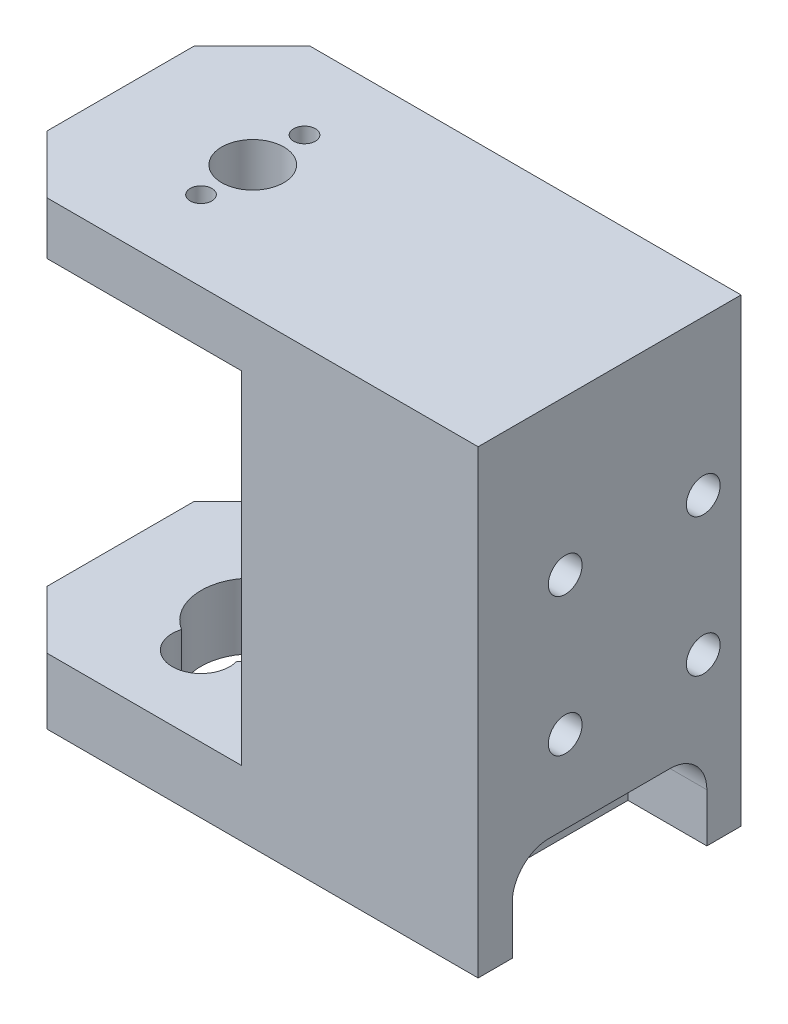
from build123d import *

# Parameters (mm, degrees)
EXTRUDE1_DEPTH                 = 12.7
SKETCH3_W                      = 3.7084
SKETCH3_H                      = 38.1
CUT_EXTRUDE1_DEPTH             = 1.27
SKETCH4_R                      = 4.99745
CUT_EXTRUDE2_DEPTH             = 2.032
SKETCH11_W                     = 16.51
SKETCH11_H                     = 33.02
EXTRUDE2_DEPTH                 = 4.7625
SKETCH12_R                     = 3.77063
CUT_EXTRUDE4_DEPTH             = 61.779817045
EXTRUDE3_DEPTH                 = 6.35
CUT_EXTRUDE5_REACH             = 68.099
SKETCH14_R                     = 4.9911
SKETCH17_W                     = 3.7084
SKETCH17_H                     = 44.45
EXTRUDE4_DEPTH                 = 1.27
CHAMFER1_SIZE                  = 5.588
SKETCH18_W                     = 11.176
SKETCH18_H                     = 2.54
CUT_EXTRUDE7_DEPTH             = 12.7
F_5_40_TAPPED_HOLE1_D          = 2.5781
F_5_40_TAPPED_HOLE1_DEPTH      = 6.985
FILLET1_R                      = 6.604
F_30_0_128500_DIAMETER_HOLE1_D = 3.2639
SKETCH25_R                     = 4.99745
SKETCH25_R_2                   = 2.9972
EXTRUDE5_DEPTH                 = 5.08
CBORE_FOR_M2_SHCS1_D           = 2.1
CBORE_FOR_M2_SHCS1_DEPTH       = 5.08
CBORE_FOR_M2_SHCS1_CBORE_D     = 3.97
CBORE_FOR_M2_SHCS1_CBORE_DEPTH = 3
SKETCH28_R                     = 2.77876
CUT_EXTRUDE8_DEPTH             = 6.35
SKETCH29_W                     = 18.796
SKETCH29_H                     = 8.255
CUT_EXTRUDE9_DEPTH             = 7.62
FILLET2_R                      = 3.556


with BuildPart() as part:
    # Sketch1 → Extrude1 (new body)
    with BuildSketch(Plane.XY):
        Polygon((-6.35, -5.08), (-47.244, -5.08), (-47.244, 0), (0, 0), (0, -38.1), (-6.35, -38.1), align=None)
    extrude1 = extrude(amount=EXTRUDE1_DEPTH)

    # Mirror1: Extrude1 across plane
    add(extrude1.mirror(Plane.XY))

    # Sketch3 → Cut-Extrude1 (cut)
    with BuildSketch(Plane(origin=(0, 0, 0), x_dir=(0, 0, -1), z_dir=(1, 0, 0))):
        with Locations((10.8458, -19.05)):
            Rectangle(SKETCH3_W, SKETCH3_H)
        with Locations((-10.8458, -19.05)):
            Rectangle(SKETCH3_W, SKETCH3_H)
    extrude(amount=-CUT_EXTRUDE1_DEPTH, mode=Mode.SUBTRACT)

    # Sketch4 → Cut-Extrude2 (cut)
    with BuildSketch(Plane(origin=(0, 0, 0), x_dir=(-1, 0, 0), z_dir=(0, 1, 0))):
        with Locations(Location((34.47288, 0, 0), (0, 0, 90))):
            Circle(SKETCH4_R)
    extrude(amount=-CUT_EXTRUDE2_DEPTH, mode=Mode.SUBTRACT)

    # Sketch11 → Extrude2 (add)
    with BuildSketch(Plane.XY.offset(12.7)):
        with Locations((-14.605, -21.59)):
            Rectangle(SKETCH11_W, SKETCH11_H)
    extrude(amount=-EXTRUDE2_DEPTH)

    # Sketch12 → Cut-Extrude4 (cut, through all)
    with BuildSketch(Plane(origin=(0, -2.032, 0), x_dir=(-1, 0, 0), z_dir=(0, 1, 0))):
        with Locations(Location((34.47288, 0, 0), (0, 0, 90))):
            Circle(SKETCH12_R)
    extrude(amount=-CUT_EXTRUDE4_DEPTH, mode=Mode.SUBTRACT)

    # Sketch13 → Extrude3 (add)
    with BuildSketch(Plane.XZ.offset(38.1)):
        Polygon((-1.27, -8.9916), (-1.27, -12.7), (-47.244, -12.7), (-47.244, 12.7), (-1.27, 12.7), (-1.27, 8.9916), (0, 8.9916), (0, -8.9916), align=None)
    extrude(amount=EXTRUDE3_DEPTH)

    # Sketch14 → Cut-Extrude5 (cut, up to next)
    with BuildSketch(Plane.XZ.offset(44.45), mode=Mode.PRIVATE) as cut_extrude5_sk1:
        with Locations(Location((-34.47288, 0, 0), (0, 0, 270))):
            Circle(SKETCH14_R)
    cut_extrude5_tool1 = extrude(cut_extrude5_sk1.sketch, amount=-CUT_EXTRUDE5_REACH, mode=Mode.PRIVATE) & part.part
    add(cut_extrude5_tool1.solids().sort_by_distance((-34.47288, -44.45, 0))[0], mode=Mode.SUBTRACT)

    # Sketch17 → Extrude4 (add)
    with BuildSketch(Plane(origin=(-1.27, 0, 0), x_dir=(0, 0, -1), z_dir=(1, 0, 0))):
        with Locations((10.8458, -22.225)):
            Rectangle(SKETCH17_W, SKETCH17_H)
    extrude4 = extrude(amount=EXTRUDE4_DEPTH)

    # Mirror2: Extrude4 across plane
    add(extrude4.mirror(Plane.XY))

    # Chamfer1
    chamfer1_edges = [part.edges().sort_by_distance(p)[0] for p in [
        (-47.244, -2.54, -12.7),
        (-47.244, -2.54, 12.7),
        (-47.244, -41.275, -12.7),
        (-47.244, -41.275, 12.7),
    ]]
    chamfer(chamfer1_edges, length=CHAMFER1_SIZE)

    # Sketch18 → Cut-Extrude7 (cut)
    with BuildSketch(Plane.XZ.offset(44.45)):
        with Locations((-19.453225, -11.43)):
            Rectangle(SKETCH18_W, SKETCH18_H)
    extrude(amount=-CUT_EXTRUDE7_DEPTH, mode=Mode.SUBTRACT)

    # 5-40 Tapped Hole1
    with Locations(Plane(origin=(0, 0, -12.7), x_dir=(-1, 0, 0), z_dir=(0, 0, -1))):
        with Locations((29.435425, -41.275), (10.385425, -41.275)):
            Hole(F_5_40_TAPPED_HOLE1_D / 2, depth=F_5_40_TAPPED_HOLE1_DEPTH)

    # Fillet1
    fillet1_edges = [part.edges().sort_by_distance(p)[0] for p in [
        (-6.35, -38.1, -2.38125),
        (-6.35, -5.08, -2.38125),
    ]]
    fillet(fillet1_edges, radius=FILLET1_R)

    # 30 _0.128500_ Diameter Hole1 (through all)
    with Locations(Plane(origin=(0, 0, 0), x_dir=(0, 0, -1), z_dir=(1, 0, 0))):
        with Locations((-4.28625, -14.9225), (9.04875, -14.9225), (-4.28625, -28.2575), (9.04875, -28.2575)):
            Hole(F_30_0_128500_DIAMETER_HOLE1_D / 2)

    # Sketch25 → Extrude5 (add)
    with BuildSketch(Plane(origin=(0, 0, 0), x_dir=(-1, 0, 0), z_dir=(0, 1, 0))):
        with Locations((34.47288, 0)):
            Circle(SKETCH25_R)
        with Locations((34.47288, 0)):
            Circle(SKETCH25_R_2, mode=Mode.SUBTRACT)
    extrude(amount=-EXTRUDE5_DEPTH)

    # CBORE for M2 SHCS1
    with Locations(Plane.XZ.offset(5.08)):
        with Locations((-34.47288, 4.99999), (-34.47288, -4.99999)):
            CounterBoreHole(CBORE_FOR_M2_SHCS1_D / 2, CBORE_FOR_M2_SHCS1_CBORE_D / 2, CBORE_FOR_M2_SHCS1_CBORE_DEPTH, depth=CBORE_FOR_M2_SHCS1_DEPTH)

    # Sketch28 → Cut-Extrude8 (cut)
    with BuildSketch(Plane.XZ.offset(44.45)):
        with Locations((-34.47288, -4.99999)):
            Circle(SKETCH28_R)
        with Locations((-34.47288, 4.99999)):
            Circle(SKETCH28_R)
    extrude(amount=-CUT_EXTRUDE8_DEPTH, mode=Mode.SUBTRACT)

    # Sketch29 → Cut-Extrude9 (cut)
    with BuildSketch(Plane(origin=(0, 0, 0), x_dir=(0, 0, -1), z_dir=(1, 0, 0))):
        with Locations((0, -40.3225)):
            Rectangle(SKETCH29_W, SKETCH29_H)
    extrude(amount=-CUT_EXTRUDE9_DEPTH, mode=Mode.SUBTRACT)

    # Fillet2
    fillet2_edges = [part.edges().sort_by_distance(p)[0] for p in [
        (-3.81, -36.195, 9.398),
        (-3.81, -36.195, -9.398),
    ]]
    fillet(fillet2_edges, radius=FILLET2_R)


solid = part.part
